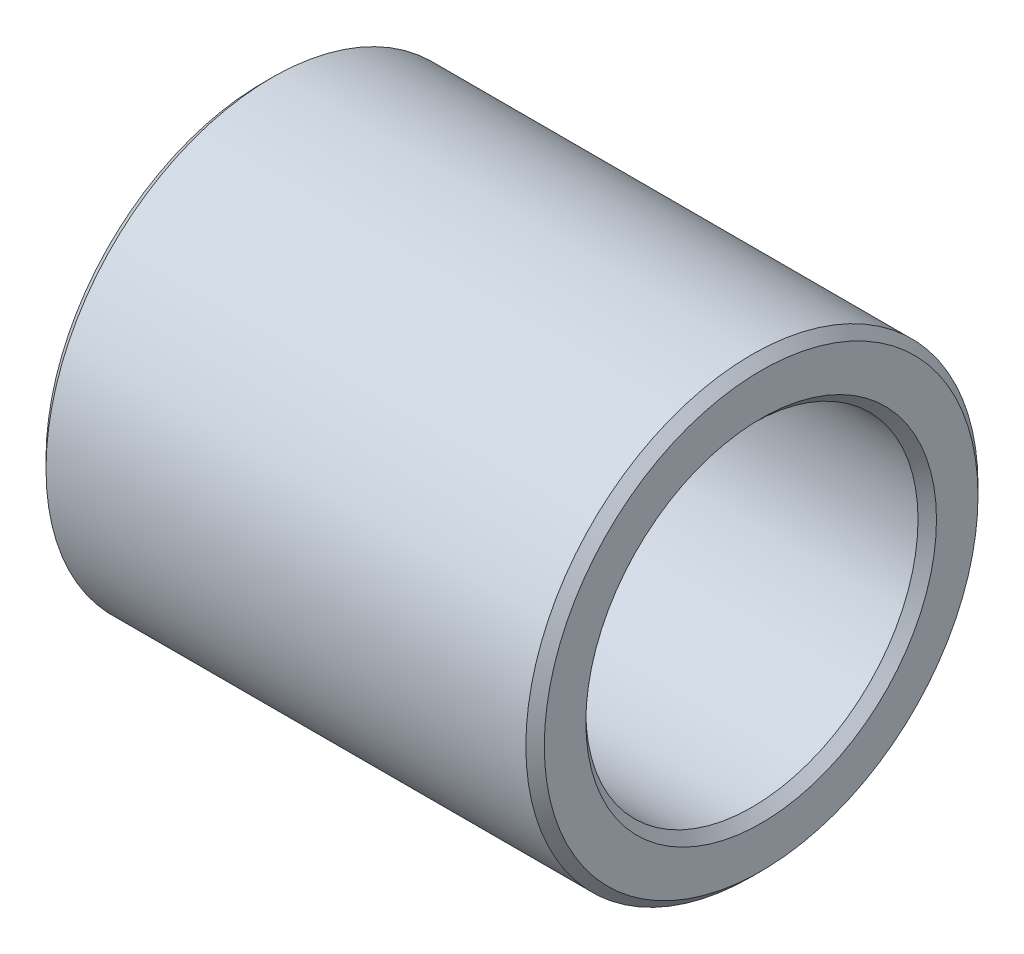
ISO-10303-21;
HEADER;
FILE_DESCRIPTION(('STEP AP214'),'2;1');
FILE_NAME('part.step','',(''),(''),'','','');
FILE_SCHEMA(('AUTOMOTIVE_DESIGN { 1 0 10303 214 1 1 1 1 }'));
ENDSEC;
DATA;
#1=APPLICATION_CONTEXT('core data for automotive mechanical design processes');
#2=APPLICATION_PROTOCOL_DEFINITION('international standard','automotive_design',2000,#1);
#3=PRODUCT_CONTEXT('',#1,'mechanical');
#4=PRODUCT('Part','Part','',(#3));
#5=PRODUCT_RELATED_PRODUCT_CATEGORY('part','',(#4));
#6=PRODUCT_DEFINITION_FORMATION('','',#4);
#7=PRODUCT_DEFINITION_CONTEXT('part definition',#1,'design');
#8=PRODUCT_DEFINITION('design','',#6,#7);
#9=PRODUCT_DEFINITION_SHAPE('','',#8);
#10=(LENGTH_UNIT() NAMED_UNIT(*) SI_UNIT(.MILLI.,.METRE.));
#11=(NAMED_UNIT(*) PLANE_ANGLE_UNIT() SI_UNIT($,.RADIAN.));
#12=(NAMED_UNIT(*) SI_UNIT($,.STERADIAN.) SOLID_ANGLE_UNIT());
#13=UNCERTAINTY_MEASURE_WITH_UNIT(LENGTH_MEASURE(1.E-05),#10,'distance_accuracy_value','');
#14=(GEOMETRIC_REPRESENTATION_CONTEXT(3) GLOBAL_UNCERTAINTY_ASSIGNED_CONTEXT((#13)) GLOBAL_UNIT_ASSIGNED_CONTEXT((#10,
#11,#12)) REPRESENTATION_CONTEXT('',''));
#15=CARTESIAN_POINT('',(0.,0.,0.));
#16=DIRECTION('',(0.,0.,1.));
#17=DIRECTION('',(1.,0.,0.));
#18=AXIS2_PLACEMENT_3D('',#15,#16,#17);
#19=CARTESIAN_POINT('',(0.,0.,0.));
#20=DIRECTION('',(-1.,0.,0.));
#21=DIRECTION('',(0.,0.,1.));
#22=AXIS2_PLACEMENT_3D('',#19,#20,#21);
#23=CYLINDRICAL_SURFACE('',#22,9.00000000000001);
#24=CARTESIAN_POINT('',(-13.,0.,0.));
#25=DIRECTION('',(-1.,0.,0.));
#26=DIRECTION('',(0.,0.,1.));
#27=AXIS2_PLACEMENT_3D('',#24,#25,#26);
#28=CIRCLE('',#27,9.00000000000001);
#29=CARTESIAN_POINT('',(-13.,0.,9.00000000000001));
#30=VERTEX_POINT('',#29);
#31=EDGE_CURVE('E55',#30,#30,#28,.T.);
#32=ORIENTED_EDGE('',*,*,#31,.T.);
#33=EDGE_LOOP('',(#32));
#34=FACE_BOUND('',#33,.T.);
#35=CARTESIAN_POINT('',(13.,0.,0.));
#36=DIRECTION('',(1.,0.,0.));
#37=DIRECTION('',(0.,0.,-1.));
#38=AXIS2_PLACEMENT_3D('',#35,#36,#37);
#39=CIRCLE('',#38,9.00000000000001);
#40=CARTESIAN_POINT('',(13.,0.,-9.00000000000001));
#41=VERTEX_POINT('',#40);
#42=EDGE_CURVE('E58',#41,#41,#39,.T.);
#43=ORIENTED_EDGE('',*,*,#42,.T.);
#44=EDGE_LOOP('',(#43));
#45=FACE_BOUND('',#44,.T.);
#46=ADVANCED_FACE('F30',(#34,#45),#23,.F.);
#47=CARTESIAN_POINT('',(-13.5,9.,0.));
#48=DIRECTION('',(-1.,0.,0.));
#49=DIRECTION('',(0.,0.,1.));
#50=AXIS2_PLACEMENT_3D('',#47,#48,#49);
#51=PLANE('',#50);
#52=CARTESIAN_POINT('',(-13.5,0.,0.));
#53=DIRECTION('',(-1.,0.,0.));
#54=DIRECTION('',(0.,0.,1.));
#55=AXIS2_PLACEMENT_3D('',#52,#53,#54);
#56=CIRCLE('',#55,9.50000000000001);
#57=CARTESIAN_POINT('',(-13.5,0.,9.50000000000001));
#58=VERTEX_POINT('',#57);
#59=EDGE_CURVE('E49',#58,#58,#56,.F.);
#60=ORIENTED_EDGE('',*,*,#59,.T.);
#61=EDGE_LOOP('',(#60));
#62=FACE_BOUND('',#61,.T.);
#63=CARTESIAN_POINT('',(-13.5,0.,0.));
#64=DIRECTION('',(-1.,0.,0.));
#65=DIRECTION('',(0.,0.,1.));
#66=AXIS2_PLACEMENT_3D('',#63,#64,#65);
#67=CIRCLE('',#66,11.75);
#68=CARTESIAN_POINT('',(-13.5,0.,11.75));
#69=VERTEX_POINT('',#68);
#70=EDGE_CURVE('E52',#69,#69,#67,.T.);
#71=ORIENTED_EDGE('',*,*,#70,.T.);
#72=EDGE_LOOP('',(#71));
#73=FACE_BOUND('',#72,.T.);
#74=ADVANCED_FACE('F88',(#62,#73),#51,.T.);
#75=CARTESIAN_POINT('',(0.,0.,0.));
#76=DIRECTION('',(-1.,0.,0.));
#77=DIRECTION('',(0.,0.,1.));
#78=AXIS2_PLACEMENT_3D('',#75,#76,#77);
#79=CYLINDRICAL_SURFACE('',#78,12.25);
#80=CARTESIAN_POINT('',(-13.,0.,0.));
#81=DIRECTION('',(-1.,0.,0.));
#82=DIRECTION('',(0.,0.,1.));
#83=AXIS2_PLACEMENT_3D('',#80,#81,#82);
#84=CIRCLE('',#83,12.25);
#85=CARTESIAN_POINT('',(-13.,0.,12.25));
#86=VERTEX_POINT('',#85);
#87=EDGE_CURVE('E10',#86,#86,#84,.F.);
#88=ORIENTED_EDGE('',*,*,#87,.T.);
#89=EDGE_LOOP('',(#88));
#90=FACE_BOUND('',#89,.T.);
#91=CARTESIAN_POINT('',(13.,0.,0.));
#92=DIRECTION('',(1.,0.,0.));
#93=DIRECTION('',(0.,0.,-1.));
#94=AXIS2_PLACEMENT_3D('',#91,#92,#93);
#95=CIRCLE('',#94,12.25);
#96=CARTESIAN_POINT('',(13.,0.,-12.25));
#97=VERTEX_POINT('',#96);
#98=EDGE_CURVE('E36',#97,#97,#95,.F.);
#99=ORIENTED_EDGE('',*,*,#98,.T.);
#100=EDGE_LOOP('',(#99));
#101=FACE_BOUND('',#100,.T.);
#102=ADVANCED_FACE('F74',(#90,#101),#79,.T.);
#103=CARTESIAN_POINT('',(13.5,12.25,0.));
#104=DIRECTION('',(1.,0.,0.));
#105=DIRECTION('',(0.,0.,-1.));
#106=AXIS2_PLACEMENT_3D('',#103,#104,#105);
#107=PLANE('',#106);
#108=CARTESIAN_POINT('',(13.5,0.,0.));
#109=DIRECTION('',(1.,0.,0.));
#110=DIRECTION('',(0.,0.,-1.));
#111=AXIS2_PLACEMENT_3D('',#108,#109,#110);
#112=CIRCLE('',#111,9.50000000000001);
#113=CARTESIAN_POINT('',(13.5,0.,-9.50000000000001));
#114=VERTEX_POINT('',#113);
#115=EDGE_CURVE('E40',#114,#114,#112,.F.);
#116=ORIENTED_EDGE('',*,*,#115,.T.);
#117=EDGE_LOOP('',(#116));
#118=FACE_BOUND('',#117,.T.);
#119=CARTESIAN_POINT('',(13.5,0.,0.));
#120=DIRECTION('',(1.,0.,0.));
#121=DIRECTION('',(0.,0.,-1.));
#122=AXIS2_PLACEMENT_3D('',#119,#120,#121);
#123=CIRCLE('',#122,11.75);
#124=CARTESIAN_POINT('',(13.5,0.,-11.75));
#125=VERTEX_POINT('',#124);
#126=EDGE_CURVE('E44',#125,#125,#123,.T.);
#127=ORIENTED_EDGE('',*,*,#126,.T.);
#128=EDGE_LOOP('',(#127));
#129=FACE_BOUND('',#128,.T.);
#130=ADVANCED_FACE('F71',(#118,#129),#107,.T.);
#131=CARTESIAN_POINT('',(-13.,0.,0.));
#132=DIRECTION('',(-1.,0.,0.));
#133=DIRECTION('',(0.,0.,1.));
#134=AXIS2_PLACEMENT_3D('',#131,#132,#133);
#135=CONICAL_SURFACE('',#134,9.00000000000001,0.785398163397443);
#136=ORIENTED_EDGE('',*,*,#59,.F.);
#137=EDGE_LOOP('',(#136));
#138=FACE_BOUND('',#137,.T.);
#139=ORIENTED_EDGE('',*,*,#31,.F.);
#140=EDGE_LOOP('',(#139));
#141=FACE_BOUND('',#140,.T.);
#142=ADVANCED_FACE('F67',(#138,#141),#135,.F.);
#143=CARTESIAN_POINT('',(13.5,0.,0.));
#144=DIRECTION('',(1.,0.,0.));
#145=DIRECTION('',(0.,0.,-1.));
#146=AXIS2_PLACEMENT_3D('',#143,#144,#145);
#147=CONICAL_SURFACE('',#146,9.50000000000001,0.785398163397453);
#148=ORIENTED_EDGE('',*,*,#42,.F.);
#149=EDGE_LOOP('',(#148));
#150=FACE_BOUND('',#149,.T.);
#151=ORIENTED_EDGE('',*,*,#115,.F.);
#152=EDGE_LOOP('',(#151));
#153=FACE_BOUND('',#152,.T.);
#154=ADVANCED_FACE('F63',(#150,#153),#147,.F.);
#155=CARTESIAN_POINT('',(-13.5,0.,0.));
#156=DIRECTION('',(1.,0.,0.));
#157=DIRECTION('',(0.,0.,-1.));
#158=AXIS2_PLACEMENT_3D('',#155,#156,#157);
#159=CONICAL_SURFACE('',#158,11.75,0.785398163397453);
#160=ORIENTED_EDGE('',*,*,#87,.F.);
#161=EDGE_LOOP('',(#160));
#162=FACE_BOUND('',#161,.T.);
#163=ORIENTED_EDGE('',*,*,#70,.F.);
#164=EDGE_LOOP('',(#163));
#165=FACE_BOUND('',#164,.T.);
#166=ADVANCED_FACE('F66',(#162,#165),#159,.T.);
#167=CARTESIAN_POINT('',(13.,0.,0.));
#168=DIRECTION('',(-1.,0.,0.));
#169=DIRECTION('',(0.,0.,1.));
#170=AXIS2_PLACEMENT_3D('',#167,#168,#169);
#171=CONICAL_SURFACE('',#170,12.25,0.785398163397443);
#172=ORIENTED_EDGE('',*,*,#126,.F.);
#173=EDGE_LOOP('',(#172));
#174=FACE_BOUND('',#173,.T.);
#175=ORIENTED_EDGE('',*,*,#98,.F.);
#176=EDGE_LOOP('',(#175));
#177=FACE_BOUND('',#176,.T.);
#178=ADVANCED_FACE('F78',(#174,#177),#171,.T.);
#179=CLOSED_SHELL('',(#46,#74,#102,#130,#142,#154,#166,#178));
#180=MANIFOLD_SOLID_BREP('B2',#179);
#181=ADVANCED_BREP_SHAPE_REPRESENTATION('',(#18,#180),#14);
#182=SHAPE_DEFINITION_REPRESENTATION(#9,#181);
ENDSEC;
END-ISO-10303-21;
